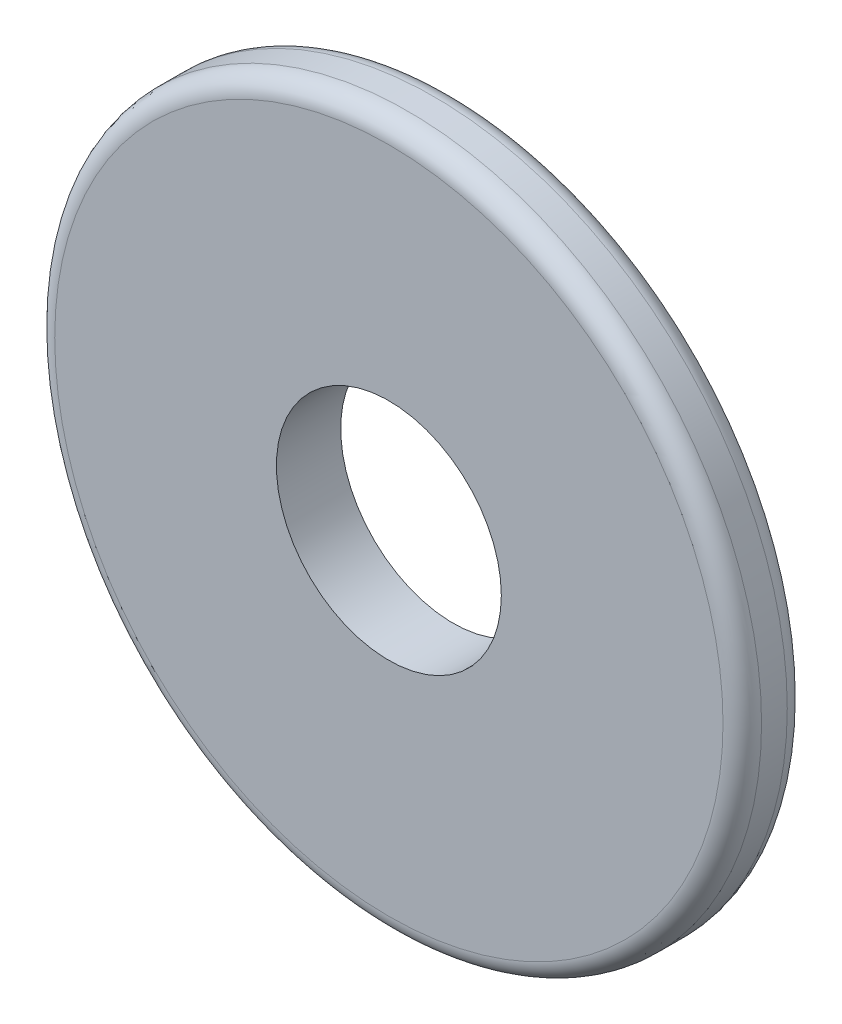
from build123d import *

# Parameters (mm, degrees)
ESQUISSE1_R          = 5.5
ESQUISSE1_R_2        = 1.75
BASE_EXTRUSION_DEPTH = 1
CONG_1_R             = 0.3


with BuildPart() as part:
    # Esquisse1 → Base-Extrusion (new body)
    with BuildSketch(Plane.XY):
        Circle(ESQUISSE1_R)
        Circle(ESQUISSE1_R_2, mode=Mode.SUBTRACT)
    extrude(amount=BASE_EXTRUSION_DEPTH)

    # Cong_1
    cong_1_edges = [part.edges().sort_by_distance(p)[0] for p in [
        (-5.5, 0, 0),
        (-5.5, 0, 1),
    ]]
    fillet(cong_1_edges, radius=CONG_1_R)


solid = part.part
